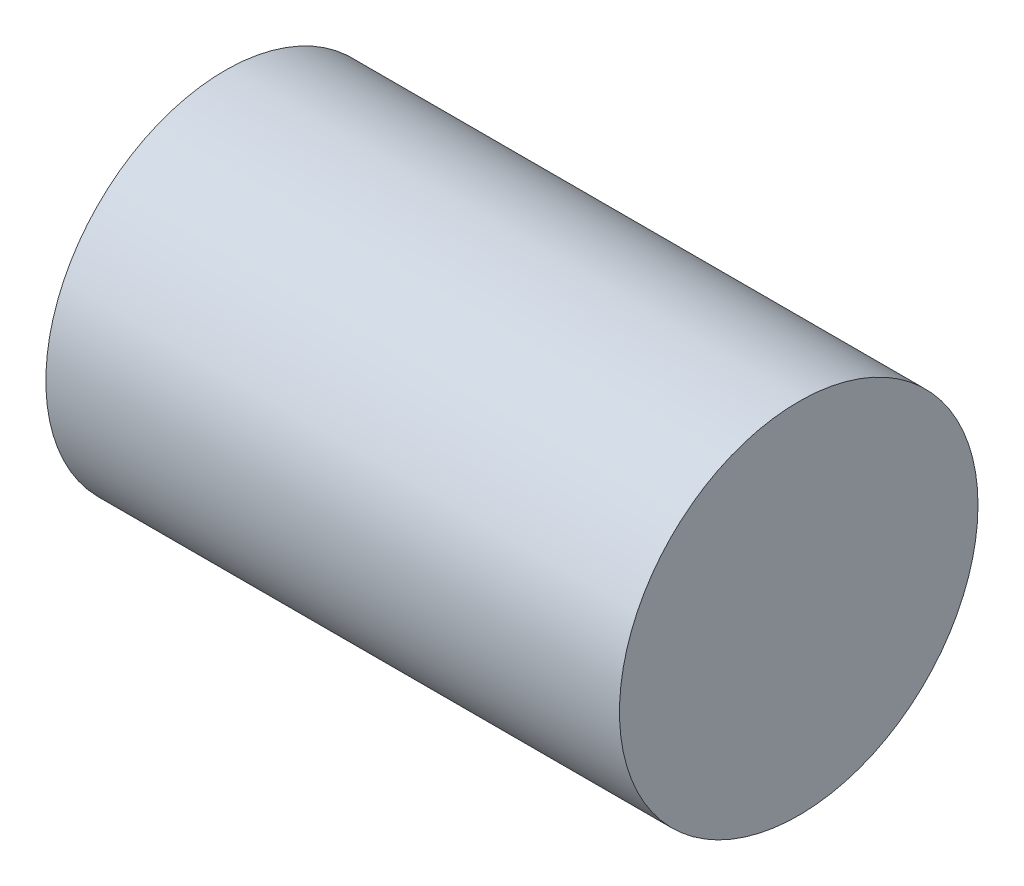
ISO-10303-21;
HEADER;
FILE_DESCRIPTION(('STEP AP214'),'2;1');
FILE_NAME('part.step','',(''),(''),'','','');
FILE_SCHEMA(('AUTOMOTIVE_DESIGN { 1 0 10303 214 1 1 1 1 }'));
ENDSEC;
DATA;
#1=APPLICATION_CONTEXT('core data for automotive mechanical design processes');
#2=APPLICATION_PROTOCOL_DEFINITION('international standard','automotive_design',2000,#1);
#3=PRODUCT_CONTEXT('',#1,'mechanical');
#4=PRODUCT('Part','Part','',(#3));
#5=PRODUCT_RELATED_PRODUCT_CATEGORY('part','',(#4));
#6=PRODUCT_DEFINITION_FORMATION('','',#4);
#7=PRODUCT_DEFINITION_CONTEXT('part definition',#1,'design');
#8=PRODUCT_DEFINITION('design','',#6,#7);
#9=PRODUCT_DEFINITION_SHAPE('','',#8);
#10=(LENGTH_UNIT() NAMED_UNIT(*) SI_UNIT(.MILLI.,.METRE.));
#11=(NAMED_UNIT(*) PLANE_ANGLE_UNIT() SI_UNIT($,.RADIAN.));
#12=(NAMED_UNIT(*) SI_UNIT($,.STERADIAN.) SOLID_ANGLE_UNIT());
#13=UNCERTAINTY_MEASURE_WITH_UNIT(LENGTH_MEASURE(1.E-05),#10,'distance_accuracy_value','');
#14=(GEOMETRIC_REPRESENTATION_CONTEXT(3) GLOBAL_UNCERTAINTY_ASSIGNED_CONTEXT((#13)) GLOBAL_UNIT_ASSIGNED_CONTEXT((#10,
#11,#12)) REPRESENTATION_CONTEXT('',''));
#15=CARTESIAN_POINT('',(0.,0.,0.));
#16=DIRECTION('',(0.,0.,1.));
#17=DIRECTION('',(1.,0.,0.));
#18=AXIS2_PLACEMENT_3D('',#15,#16,#17);
#19=CARTESIAN_POINT('',(8.,0.,0.));
#20=DIRECTION('',(-1.,0.,0.));
#21=DIRECTION('',(0.,0.,1.));
#22=AXIS2_PLACEMENT_3D('',#19,#20,#21);
#23=CYLINDRICAL_SURFACE('',#22,2.5);
#24=CARTESIAN_POINT('',(8.,0.,0.));
#25=DIRECTION('',(1.,0.,0.));
#26=DIRECTION('',(0.,0.,-1.));
#27=AXIS2_PLACEMENT_3D('',#24,#25,#26);
#28=CIRCLE('',#27,2.5);
#29=CARTESIAN_POINT('',(8.,0.,-2.5));
#30=VERTEX_POINT('',#29);
#31=EDGE_CURVE('E10',#30,#30,#28,.T.);
#32=ORIENTED_EDGE('',*,*,#31,.F.);
#33=EDGE_LOOP('',(#32));
#34=FACE_BOUND('',#33,.T.);
#35=CARTESIAN_POINT('',(0.,0.,0.));
#36=DIRECTION('',(1.,0.,0.));
#37=DIRECTION('',(0.,0.,-1.));
#38=AXIS2_PLACEMENT_3D('',#35,#36,#37);
#39=CIRCLE('',#38,2.5);
#40=CARTESIAN_POINT('',(0.,0.,-2.5));
#41=VERTEX_POINT('',#40);
#42=EDGE_CURVE('E30',#41,#41,#39,.T.);
#43=ORIENTED_EDGE('',*,*,#42,.T.);
#44=EDGE_LOOP('',(#43));
#45=FACE_BOUND('',#44,.T.);
#46=ADVANCED_FACE('F24',(#34,#45),#23,.T.);
#47=CARTESIAN_POINT('',(8.,0.,0.));
#48=DIRECTION('',(1.,0.,0.));
#49=DIRECTION('',(0.,0.,-1.));
#50=AXIS2_PLACEMENT_3D('',#47,#48,#49);
#51=PLANE('',#50);
#52=ORIENTED_EDGE('',*,*,#31,.T.);
#53=EDGE_LOOP('',(#52));
#54=FACE_BOUND('',#53,.T.);
#55=ADVANCED_FACE('F39',(#54),#51,.T.);
#56=CARTESIAN_POINT('',(0.,0.,0.));
#57=DIRECTION('',(1.,0.,0.));
#58=DIRECTION('',(0.,0.,-1.));
#59=AXIS2_PLACEMENT_3D('',#56,#57,#58);
#60=PLANE('',#59);
#61=ORIENTED_EDGE('',*,*,#42,.F.);
#62=EDGE_LOOP('',(#61));
#63=FACE_BOUND('',#62,.T.);
#64=ADVANCED_FACE('F37',(#63),#60,.F.);
#65=CLOSED_SHELL('',(#46,#55,#64));
#66=MANIFOLD_SOLID_BREP('B2',#65);
#67=ADVANCED_BREP_SHAPE_REPRESENTATION('',(#18,#66),#14);
#68=SHAPE_DEFINITION_REPRESENTATION(#9,#67);
ENDSEC;
END-ISO-10303-21;
